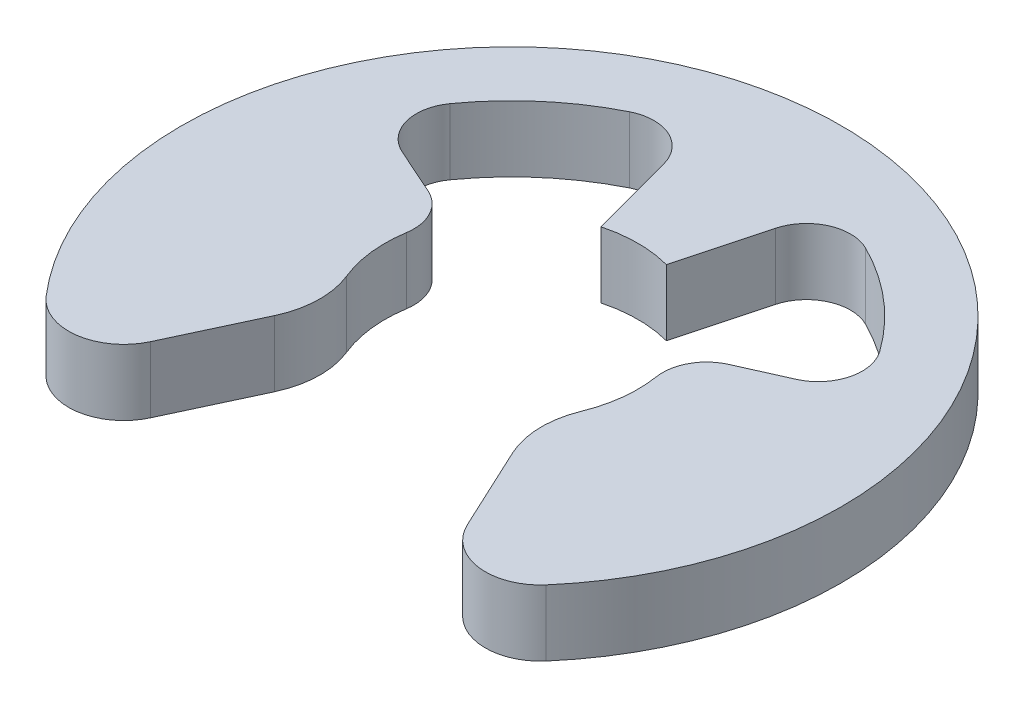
ISO-10303-21;
HEADER;
FILE_DESCRIPTION(('STEP AP214'),'2;1');
FILE_NAME('part.step','',(''),(''),'','','');
FILE_SCHEMA(('AUTOMOTIVE_DESIGN { 1 0 10303 214 1 1 1 1 }'));
ENDSEC;
DATA;
#1=APPLICATION_CONTEXT('core data for automotive mechanical design processes');
#2=APPLICATION_PROTOCOL_DEFINITION('international standard','automotive_design',2000,#1);
#3=PRODUCT_CONTEXT('',#1,'mechanical');
#4=PRODUCT('Part','Part','',(#3));
#5=PRODUCT_RELATED_PRODUCT_CATEGORY('part','',(#4));
#6=PRODUCT_DEFINITION_FORMATION('','',#4);
#7=PRODUCT_DEFINITION_CONTEXT('part definition',#1,'design');
#8=PRODUCT_DEFINITION('design','',#6,#7);
#9=PRODUCT_DEFINITION_SHAPE('','',#8);
#10=(LENGTH_UNIT() NAMED_UNIT(*) SI_UNIT(.MILLI.,.METRE.));
#11=(NAMED_UNIT(*) PLANE_ANGLE_UNIT() SI_UNIT($,.RADIAN.));
#12=(NAMED_UNIT(*) SI_UNIT($,.STERADIAN.) SOLID_ANGLE_UNIT());
#13=UNCERTAINTY_MEASURE_WITH_UNIT(LENGTH_MEASURE(1.E-05),#10,'distance_accuracy_value','');
#14=(GEOMETRIC_REPRESENTATION_CONTEXT(3) GLOBAL_UNCERTAINTY_ASSIGNED_CONTEXT((#13)) GLOBAL_UNIT_ASSIGNED_CONTEXT((#10,
#11,#12)) REPRESENTATION_CONTEXT('',''));
#15=CARTESIAN_POINT('',(0.,0.,0.));
#16=DIRECTION('',(0.,0.,1.));
#17=DIRECTION('',(1.,0.,0.));
#18=AXIS2_PLACEMENT_3D('',#15,#16,#17);
#19=CARTESIAN_POINT('',(0.,-0.3,0.));
#20=DIRECTION('',(0.,-1.,0.));
#21=DIRECTION('',(0.,0.,-1.));
#22=AXIS2_PLACEMENT_3D('',#19,#20,#21);
#23=PLANE('',#22);
#24=DIRECTION('',(-0.422618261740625,0.,0.906307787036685));
#25=VECTOR('',#24,1.);
#26=CARTESIAN_POINT('',(-0.5408875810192,-0.3,0.5357544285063));
#27=LINE('',#26,#25);
#28=CARTESIAN_POINT('',(-0.540887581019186,-0.3,0.535754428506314));
#29=VERTEX_POINT('',#28);
#30=CARTESIAN_POINT('',(-0.720660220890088,-0.3,0.921278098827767));
#31=VERTEX_POINT('',#30);
#32=EDGE_CURVE('E190',#29,#31,#27,.T.);
#33=ORIENTED_EDGE('',*,*,#32,.T.);
#34=CARTESIAN_POINT('',(-0.9472371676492,-0.3,0.8156235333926));
#35=DIRECTION('',(0.,1.,0.));
#36=DIRECTION('',(0.,0.,1.));
#37=AXIS2_PLACEMENT_3D('',#34,#35,#36);
#38=CIRCLE('',#37,0.25);
#39=CARTESIAN_POINT('',(-1.13668460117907,-0.3,0.978748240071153));
#40=VERTEX_POINT('',#39);
#41=EDGE_CURVE('E175',#40,#31,#38,.T.);
#42=ORIENTED_EDGE('',*,*,#41,.F.);
#43=CARTESIAN_POINT('',(0.,-0.3,0.));
#44=DIRECTION('',(0.,-1.,0.));
#45=DIRECTION('',(0.,0.,-1.));
#46=AXIS2_PLACEMENT_3D('',#43,#44,#45);
#47=CIRCLE('',#46,1.5);
#48=CARTESIAN_POINT('',(1.13668460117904,-0.3,0.978748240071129));
#49=VERTEX_POINT('',#48);
#50=EDGE_CURVE('E173',#49,#40,#47,.F.);
#51=ORIENTED_EDGE('',*,*,#50,.F.);
#52=CARTESIAN_POINT('',(0.9472371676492,-0.3,0.8156235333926));
#53=DIRECTION('',(0.,1.,0.));
#54=DIRECTION('',(0.,0.,1.));
#55=AXIS2_PLACEMENT_3D('',#52,#53,#54);
#56=CIRCLE('',#55,0.25);
#57=CARTESIAN_POINT('',(0.72066022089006,-0.3,0.921278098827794));
#58=VERTEX_POINT('',#57);
#59=EDGE_CURVE('E19',#49,#58,#56,.F.);
#60=ORIENTED_EDGE('',*,*,#59,.T.);
#61=DIRECTION('',(-0.422618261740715,0.,-0.906307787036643));
#62=VECTOR('',#61,1.);
#63=CARTESIAN_POINT('',(0.7206602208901,-0.3,0.9212780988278));
#64=LINE('',#63,#62);
#65=CARTESIAN_POINT('',(0.540887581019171,-0.3,0.535754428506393));
#66=VERTEX_POINT('',#65);
#67=EDGE_CURVE('E171',#58,#66,#64,.T.);
#68=ORIENTED_EDGE('',*,*,#67,.T.);
#69=CARTESIAN_POINT('',(0.9034106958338,-0.3,0.3667071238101));
#70=DIRECTION('',(0.,1.,0.));
#71=DIRECTION('',(0.,0.,1.));
#72=AXIS2_PLACEMENT_3D('',#69,#70,#71);
#73=CIRCLE('',#72,0.4);
#74=CARTESIAN_POINT('',(0.532780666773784,-0.3,0.216263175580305));
#75=VERTEX_POINT('',#74);
#76=EDGE_CURVE('E209',#66,#75,#73,.F.);
#77=ORIENTED_EDGE('',*,*,#76,.T.);
#78=CARTESIAN_POINT('',(0.,-0.3,0.));
#79=DIRECTION('',(0.,-1.,0.));
#80=DIRECTION('',(0.,0.,-1.));
#81=AXIS2_PLACEMENT_3D('',#78,#79,#80);
#82=CIRCLE('',#81,0.575);
#83=CARTESIAN_POINT('',(0.567850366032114,-0.3,-0.0903933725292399));
#84=VERTEX_POINT('',#83);
#85=EDGE_CURVE('E285',#75,#84,#82,.F.);
#86=ORIENTED_EDGE('',*,*,#85,.T.);
#87=CARTESIAN_POINT('',(0.7653635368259,-0.3,-0.1218345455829));
#88=DIRECTION('',(0.,1.,0.));
#89=DIRECTION('',(0.,0.,1.));
#90=AXIS2_PLACEMENT_3D('',#87,#88,#89);
#91=CIRCLE('',#90,0.2);
#92=CARTESIAN_POINT('',(0.684016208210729,-0.3,-0.304543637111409));
#93=VERTEX_POINT('',#92);
#94=EDGE_CURVE('E207',#84,#93,#91,.F.);
#95=ORIENTED_EDGE('',*,*,#94,.T.);
#96=DIRECTION('',(0.913545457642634,0.,-0.406736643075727));
#97=VECTOR('',#96,1.);
#98=CARTESIAN_POINT('',(0.6840162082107,-0.3,-0.3045436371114));
#99=LINE('',#98,#97);
#100=CARTESIAN_POINT('',(0.895088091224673,-0.3,-0.398518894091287));
#101=VERTEX_POINT('',#100);
#102=EDGE_CURVE('E204',#93,#101,#99,.T.);
#103=ORIENTED_EDGE('',*,*,#102,.T.);
#104=CARTESIAN_POINT('',(0.8137407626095,-0.3,-0.5812279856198));
#105=DIRECTION('',(0.,-1.,0.));
#106=DIRECTION('',(0.,0.,-1.));
#107=AXIS2_PLACEMENT_3D('',#104,#105,#106);
#108=CIRCLE('',#107,0.2);
#109=CARTESIAN_POINT('',(0.976488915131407,-0.3,-0.697473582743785));
#110=VERTEX_POINT('',#109);
#111=EDGE_CURVE('E206',#101,#110,#108,.F.);
#112=ORIENTED_EDGE('',*,*,#111,.T.);
#113=CARTESIAN_POINT('',(0.,-0.3,0.));
#114=DIRECTION('',(0.,-1.,0.));
#115=DIRECTION('',(0.,0.,-1.));
#116=AXIS2_PLACEMENT_3D('',#113,#114,#115);
#117=CIRCLE('',#116,1.2);
#118=CARTESIAN_POINT('',(0.536130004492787,-0.3,-1.07357562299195));
#119=VERTEX_POINT('',#118);
#120=EDGE_CURVE('E281',#110,#119,#117,.F.);
#121=ORIENTED_EDGE('',*,*,#120,.T.);
#122=CARTESIAN_POINT('',(0.446775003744,-0.3,-0.8946463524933));
#123=DIRECTION('',(0.,-1.,0.));
#124=DIRECTION('',(0.,0.,-1.));
#125=AXIS2_PLACEMENT_3D('',#122,#123,#124);
#126=CIRCLE('',#125,0.2);
#127=CARTESIAN_POINT('',(0.253589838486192,-0.3,-0.946410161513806));
#128=VERTEX_POINT('',#127);
#129=EDGE_CURVE('E203',#119,#128,#126,.F.);
#130=ORIENTED_EDGE('',*,*,#129,.T.);
#131=DIRECTION('',(-0.258819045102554,0.,0.965925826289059));
#132=VECTOR('',#131,1.);
#133=CARTESIAN_POINT('',(0.2535898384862,-0.3,-0.9464101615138));
#134=LINE('',#133,#132);
#135=CARTESIAN_POINT('',(0.148820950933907,-0.3,-0.555407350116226));
#136=VERTEX_POINT('',#135);
#137=EDGE_CURVE('E201',#128,#136,#134,.T.);
#138=ORIENTED_EDGE('',*,*,#137,.T.);
#139=CARTESIAN_POINT('',(0.,-0.3,0.));
#140=DIRECTION('',(0.,-1.,0.));
#141=DIRECTION('',(0.,0.,-1.));
#142=AXIS2_PLACEMENT_3D('',#139,#140,#141);
#143=CIRCLE('',#142,0.575);
#144=CARTESIAN_POINT('',(-0.148820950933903,-0.3,-0.555407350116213));
#145=VERTEX_POINT('',#144);
#146=EDGE_CURVE('E200',#136,#145,#143,.F.);
#147=ORIENTED_EDGE('',*,*,#146,.T.);
#148=DIRECTION('',(-0.258819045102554,0.,-0.965925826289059));
#149=VECTOR('',#148,1.);
#150=CARTESIAN_POINT('',(-0.1488209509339,-0.3,-0.5554073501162));
#151=LINE('',#150,#149);
#152=CARTESIAN_POINT('',(-0.253589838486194,-0.3,-0.946410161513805));
#153=VERTEX_POINT('',#152);
#154=EDGE_CURVE('E197',#145,#153,#151,.T.);
#155=ORIENTED_EDGE('',*,*,#154,.T.);
#156=CARTESIAN_POINT('',(-0.446775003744,-0.3,-0.8946463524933));
#157=DIRECTION('',(0.,-1.,0.));
#158=DIRECTION('',(0.,0.,-1.));
#159=AXIS2_PLACEMENT_3D('',#156,#157,#158);
#160=CIRCLE('',#159,0.2);
#161=CARTESIAN_POINT('',(-0.536130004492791,-0.3,-1.07357562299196));
#162=VERTEX_POINT('',#161);
#163=EDGE_CURVE('E199',#153,#162,#160,.F.);
#164=ORIENTED_EDGE('',*,*,#163,.T.);
#165=CARTESIAN_POINT('',(0.,-0.3,0.));
#166=DIRECTION('',(0.,-1.,0.));
#167=DIRECTION('',(0.,0.,-1.));
#168=AXIS2_PLACEMENT_3D('',#165,#166,#167);
#169=CIRCLE('',#168,1.2);
#170=CARTESIAN_POINT('',(-0.976488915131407,-0.3,-0.697473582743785));
#171=VERTEX_POINT('',#170);
#172=EDGE_CURVE('E276',#162,#171,#169,.F.);
#173=ORIENTED_EDGE('',*,*,#172,.T.);
#174=CARTESIAN_POINT('',(-0.8137407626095,-0.3,-0.5812279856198));
#175=DIRECTION('',(0.,-1.,0.));
#176=DIRECTION('',(0.,0.,-1.));
#177=AXIS2_PLACEMENT_3D('',#174,#175,#176);
#178=CIRCLE('',#177,0.2);
#179=CARTESIAN_POINT('',(-0.895088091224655,-0.3,-0.398518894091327));
#180=VERTEX_POINT('',#179);
#181=EDGE_CURVE('E196',#171,#180,#178,.F.);
#182=ORIENTED_EDGE('',*,*,#181,.T.);
#183=DIRECTION('',(0.913545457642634,0.,0.406736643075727));
#184=VECTOR('',#183,1.);
#185=CARTESIAN_POINT('',(-0.8950880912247,-0.3,-0.3985188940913));
#186=LINE('',#185,#184);
#187=CARTESIAN_POINT('',(-0.684016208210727,-0.3,-0.304543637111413));
#188=VERTEX_POINT('',#187);
#189=EDGE_CURVE('E193',#180,#188,#186,.T.);
#190=ORIENTED_EDGE('',*,*,#189,.T.);
#191=CARTESIAN_POINT('',(-0.7653635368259,-0.3,-0.1218345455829));
#192=DIRECTION('',(0.,1.,0.));
#193=DIRECTION('',(0.,0.,1.));
#194=AXIS2_PLACEMENT_3D('',#191,#192,#193);
#195=CIRCLE('',#194,0.2);
#196=CARTESIAN_POINT('',(-0.567850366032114,-0.3,-0.0903933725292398));
#197=VERTEX_POINT('',#196);
#198=EDGE_CURVE('E195',#188,#197,#195,.F.);
#199=ORIENTED_EDGE('',*,*,#198,.T.);
#200=CARTESIAN_POINT('',(0.,-0.3,0.));
#201=DIRECTION('',(0.,-1.,0.));
#202=DIRECTION('',(0.,0.,-1.));
#203=AXIS2_PLACEMENT_3D('',#200,#201,#202);
#204=CIRCLE('',#203,0.575);
#205=CARTESIAN_POINT('',(-0.532780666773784,-0.3,0.216263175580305));
#206=VERTEX_POINT('',#205);
#207=EDGE_CURVE('E272',#197,#206,#204,.F.);
#208=ORIENTED_EDGE('',*,*,#207,.T.);
#209=CARTESIAN_POINT('',(-0.9034106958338,-0.3,0.3667071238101));
#210=DIRECTION('',(0.,1.,0.));
#211=DIRECTION('',(0.,0.,1.));
#212=AXIS2_PLACEMENT_3D('',#209,#210,#211);
#213=CIRCLE('',#212,0.4);
#214=EDGE_CURVE('E192',#206,#29,#213,.F.);
#215=ORIENTED_EDGE('',*,*,#214,.T.);
#216=EDGE_LOOP('',(#33,#42,#51,#60,#68,#77,#86,#95,#103,#112,#121,#130,#138,#147,#155,#164,#173,
#182,#190,#199,#208,#215));
#217=FACE_BOUND('',#216,.T.);
#218=ADVANCED_FACE('F16',(#217),#23,.T.);
#219=CARTESIAN_POINT('',(-0.9472371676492,-0.3084106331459,0.8156235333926));
#220=DIRECTION('',(0.,1.,0.));
#221=DIRECTION('',(0.,0.,1.));
#222=AXIS2_PLACEMENT_3D('',#219,#220,#221);
#223=CYLINDRICAL_SURFACE('',#222,0.25);
#224=ORIENTED_EDGE('',*,*,#41,.T.);
#225=DIRECTION('',(0.,1.,0.));
#226=VECTOR('',#225,1.);
#227=CARTESIAN_POINT('',(-0.720660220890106,0.,0.921278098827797));
#228=LINE('',#227,#226);
#229=CARTESIAN_POINT('',(-0.720660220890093,0.,0.921278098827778));
#230=VERTEX_POINT('',#229);
#231=EDGE_CURVE('E259',#230,#31,#228,.F.);
#232=ORIENTED_EDGE('',*,*,#231,.F.);
#233=CARTESIAN_POINT('',(-0.9472371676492,0.,0.8156235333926));
#234=DIRECTION('',(0.,1.,0.));
#235=DIRECTION('',(0.,0.,1.));
#236=AXIS2_PLACEMENT_3D('',#233,#234,#235);
#237=CIRCLE('',#236,0.25);
#238=CARTESIAN_POINT('',(-1.13668460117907,0.,0.978748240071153));
#239=VERTEX_POINT('',#238);
#240=EDGE_CURVE('E256',#230,#239,#237,.F.);
#241=ORIENTED_EDGE('',*,*,#240,.T.);
#242=DIRECTION('',(0.,-1.,0.));
#243=VECTOR('',#242,1.);
#244=CARTESIAN_POINT('',(-1.13668460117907,0.,0.978748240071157));
#245=LINE('',#244,#243);
#246=EDGE_CURVE('E178',#40,#239,#245,.F.);
#247=ORIENTED_EDGE('',*,*,#246,.F.);
#248=EDGE_LOOP('',(#224,#232,#241,#247));
#249=FACE_BOUND('',#248,.T.);
#250=ADVANCED_FACE('F398',(#249),#223,.T.);
#251=CARTESIAN_POINT('',(0.,0.,0.));
#252=DIRECTION('',(0.,-1.,0.));
#253=DIRECTION('',(0.,0.,-1.));
#254=AXIS2_PLACEMENT_3D('',#251,#252,#253);
#255=CYLINDRICAL_SURFACE('',#254,1.5);
#256=ORIENTED_EDGE('',*,*,#50,.T.);
#257=ORIENTED_EDGE('',*,*,#246,.T.);
#258=CARTESIAN_POINT('',(0.,0.,0.));
#259=DIRECTION('',(0.,-1.,0.));
#260=DIRECTION('',(0.,0.,-1.));
#261=AXIS2_PLACEMENT_3D('',#258,#259,#260);
#262=CIRCLE('',#261,1.5);
#263=CARTESIAN_POINT('',(1.13668460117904,0.,0.978748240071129));
#264=VERTEX_POINT('',#263);
#265=EDGE_CURVE('E183',#239,#264,#262,.T.);
#266=ORIENTED_EDGE('',*,*,#265,.T.);
#267=DIRECTION('',(0.,1.,0.));
#268=VECTOR('',#267,1.);
#269=CARTESIAN_POINT('',(1.13668460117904,-0.3084106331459,0.978748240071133));
#270=LINE('',#269,#268);
#271=EDGE_CURVE('E166',#49,#264,#270,.T.);
#272=ORIENTED_EDGE('',*,*,#271,.F.);
#273=EDGE_LOOP('',(#256,#257,#266,#272));
#274=FACE_BOUND('',#273,.T.);
#275=ADVANCED_FACE('F181',(#274),#255,.T.);
#276=CARTESIAN_POINT('',(0.9472371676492,-0.3084106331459,0.8156235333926));
#277=DIRECTION('',(0.,1.,0.));
#278=DIRECTION('',(0.,0.,1.));
#279=AXIS2_PLACEMENT_3D('',#276,#277,#278);
#280=CYLINDRICAL_SURFACE('',#279,0.25);
#281=ORIENTED_EDGE('',*,*,#59,.F.);
#282=ORIENTED_EDGE('',*,*,#271,.T.);
#283=CARTESIAN_POINT('',(0.9472371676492,0.,0.8156235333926));
#284=DIRECTION('',(0.,1.,0.));
#285=DIRECTION('',(0.,0.,1.));
#286=AXIS2_PLACEMENT_3D('',#283,#284,#285);
#287=CIRCLE('',#286,0.25);
#288=CARTESIAN_POINT('',(0.72066022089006,0.,0.921278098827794));
#289=VERTEX_POINT('',#288);
#290=EDGE_CURVE('E253',#264,#289,#287,.F.);
#291=ORIENTED_EDGE('',*,*,#290,.T.);
#292=DIRECTION('',(0.,1.,0.));
#293=VECTOR('',#292,1.);
#294=CARTESIAN_POINT('',(0.720660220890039,0.,0.921278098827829));
#295=LINE('',#294,#293);
#296=EDGE_CURVE('E168',#58,#289,#295,.T.);
#297=ORIENTED_EDGE('',*,*,#296,.F.);
#298=EDGE_LOOP('',(#281,#282,#291,#297));
#299=FACE_BOUND('',#298,.T.);
#300=ADVANCED_FACE('F163',(#299),#280,.T.);
#301=CARTESIAN_POINT('',(0.8631235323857,0.,1.226791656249));
#302=DIRECTION('',(-0.906307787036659,0.,0.422618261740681));
#303=DIRECTION('',(0.422618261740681,0.,0.906307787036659));
#304=AXIS2_PLACEMENT_3D('',#301,#302,#303);
#305=PLANE('',#304);
#306=ORIENTED_EDGE('',*,*,#67,.F.);
#307=ORIENTED_EDGE('',*,*,#296,.T.);
#308=DIRECTION('',(-0.422618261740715,0.,-0.906307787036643));
#309=VECTOR('',#308,1.);
#310=CARTESIAN_POINT('',(0.7206602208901,0.,0.9212780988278));
#311=LINE('',#310,#309);
#312=CARTESIAN_POINT('',(0.540887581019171,0.,0.535754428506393));
#313=VERTEX_POINT('',#312);
#314=EDGE_CURVE('E252',#289,#313,#311,.T.);
#315=ORIENTED_EDGE('',*,*,#314,.T.);
#316=DIRECTION('',(0.,1.,0.));
#317=VECTOR('',#316,1.);
#318=CARTESIAN_POINT('',(0.540887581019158,-0.3084106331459,0.53575442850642));
#319=LINE('',#318,#317);
#320=EDGE_CURVE('E185',#66,#313,#319,.T.);
#321=ORIENTED_EDGE('',*,*,#320,.F.);
#322=EDGE_LOOP('',(#306,#307,#315,#321));
#323=FACE_BOUND('',#322,.T.);
#324=ADVANCED_FACE('F446',(#323),#305,.T.);
#325=CARTESIAN_POINT('',(0.9034106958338,-0.3084106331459,0.3667071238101));
#326=DIRECTION('',(0.,1.,0.));
#327=DIRECTION('',(0.,0.,1.));
#328=AXIS2_PLACEMENT_3D('',#325,#326,#327);
#329=CYLINDRICAL_SURFACE('',#328,0.4);
#330=ORIENTED_EDGE('',*,*,#76,.F.);
#331=ORIENTED_EDGE('',*,*,#320,.T.);
#332=CARTESIAN_POINT('',(0.9034106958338,0.,0.3667071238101));
#333=DIRECTION('',(0.,1.,0.));
#334=DIRECTION('',(0.,0.,1.));
#335=AXIS2_PLACEMENT_3D('',#332,#333,#334);
#336=CIRCLE('',#335,0.4);
#337=CARTESIAN_POINT('',(0.532780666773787,0.,0.216263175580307));
#338=VERTEX_POINT('',#337);
#339=EDGE_CURVE('E249',#313,#338,#336,.F.);
#340=ORIENTED_EDGE('',*,*,#339,.T.);
#341=DIRECTION('',(0.,-1.,0.));
#342=VECTOR('',#341,1.);
#343=CARTESIAN_POINT('',(0.532780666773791,0.,0.216263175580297));
#344=LINE('',#343,#342);
#345=EDGE_CURVE('E292',#338,#75,#344,.T.);
#346=ORIENTED_EDGE('',*,*,#345,.T.);
#347=EDGE_LOOP('',(#330,#331,#340,#346));
#348=FACE_BOUND('',#347,.T.);
#349=ADVANCED_FACE('F293',(#348),#329,.T.);
#350=CARTESIAN_POINT('',(0.,0.,0.));
#351=DIRECTION('',(0.,-1.,0.));
#352=DIRECTION('',(0.,0.,-1.));
#353=AXIS2_PLACEMENT_3D('',#350,#351,#352);
#354=CYLINDRICAL_SURFACE('',#353,0.575);
#355=DIRECTION('',(0.,1.,0.));
#356=VECTOR('',#355,1.);
#357=CARTESIAN_POINT('',(0.567850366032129,-0.3084106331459,-0.0903933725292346));
#358=LINE('',#357,#356);
#359=CARTESIAN_POINT('',(0.567850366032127,0.,-0.090393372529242));
#360=VERTEX_POINT('',#359);
#361=EDGE_CURVE('E297',#84,#360,#358,.T.);
#362=ORIENTED_EDGE('',*,*,#361,.F.);
#363=ORIENTED_EDGE('',*,*,#85,.F.);
#364=ORIENTED_EDGE('',*,*,#345,.F.);
#365=CARTESIAN_POINT('',(0.,0.,0.));
#366=DIRECTION('',(0.,-1.,0.));
#367=DIRECTION('',(0.,0.,-1.));
#368=AXIS2_PLACEMENT_3D('',#365,#366,#367);
#369=CIRCLE('',#368,0.575);
#370=EDGE_CURVE('E246',#338,#360,#369,.F.);
#371=ORIENTED_EDGE('',*,*,#370,.T.);
#372=EDGE_LOOP('',(#362,#363,#364,#371));
#373=FACE_BOUND('',#372,.T.);
#374=ADVANCED_FACE('F299',(#373),#354,.F.);
#375=CARTESIAN_POINT('',(0.7653635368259,-0.3084106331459,-0.1218345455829));
#376=DIRECTION('',(0.,1.,0.));
#377=DIRECTION('',(0.,0.,1.));
#378=AXIS2_PLACEMENT_3D('',#375,#376,#377);
#379=CYLINDRICAL_SURFACE('',#378,0.2);
#380=ORIENTED_EDGE('',*,*,#94,.F.);
#381=ORIENTED_EDGE('',*,*,#361,.T.);
#382=CARTESIAN_POINT('',(0.7653635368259,0.,-0.1218345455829));
#383=DIRECTION('',(0.,1.,0.));
#384=DIRECTION('',(0.,0.,1.));
#385=AXIS2_PLACEMENT_3D('',#382,#383,#384);
#386=CIRCLE('',#385,0.2);
#387=CARTESIAN_POINT('',(0.684016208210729,0.,-0.304543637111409));
#388=VERTEX_POINT('',#387);
#389=EDGE_CURVE('E243',#360,#388,#386,.F.);
#390=ORIENTED_EDGE('',*,*,#389,.T.);
#391=DIRECTION('',(0.,1.,0.));
#392=VECTOR('',#391,1.);
#393=CARTESIAN_POINT('',(0.684016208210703,0.,-0.304543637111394));
#394=LINE('',#393,#392);
#395=EDGE_CURVE('E303',#93,#388,#394,.T.);
#396=ORIENTED_EDGE('',*,*,#395,.F.);
#397=EDGE_LOOP('',(#380,#381,#390,#396));
#398=FACE_BOUND('',#397,.T.);
#399=ADVANCED_FACE('F306',(#398),#379,.T.);
#400=CARTESIAN_POINT('',(0.5252886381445,0.,-0.2338735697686));
#401=DIRECTION('',(-0.4067366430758,0.,-0.913545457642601));
#402=DIRECTION('',(-0.913545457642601,0.,0.4067366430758));
#403=AXIS2_PLACEMENT_3D('',#400,#401,#402);
#404=PLANE('',#403);
#405=ORIENTED_EDGE('',*,*,#102,.F.);
#406=ORIENTED_EDGE('',*,*,#395,.T.);
#407=DIRECTION('',(0.913545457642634,0.,-0.406736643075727));
#408=VECTOR('',#407,1.);
#409=CARTESIAN_POINT('',(0.6840162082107,0.,-0.3045436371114));
#410=LINE('',#409,#408);
#411=CARTESIAN_POINT('',(0.895088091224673,0.,-0.398518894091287));
#412=VERTEX_POINT('',#411);
#413=EDGE_CURVE('E242',#388,#412,#410,.T.);
#414=ORIENTED_EDGE('',*,*,#413,.T.);
#415=DIRECTION('',(0.,-1.,0.));
#416=VECTOR('',#415,1.);
#417=CARTESIAN_POINT('',(0.895088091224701,0.00718644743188,-0.398518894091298));
#418=LINE('',#417,#416);
#419=EDGE_CURVE('E313',#412,#101,#418,.T.);
#420=ORIENTED_EDGE('',*,*,#419,.T.);
#421=EDGE_LOOP('',(#405,#406,#414,#420));
#422=FACE_BOUND('',#421,.T.);
#423=ADVANCED_FACE('F314',(#422),#404,.T.);
#424=CARTESIAN_POINT('',(0.8137407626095,0.00718644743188,-0.5812279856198));
#425=DIRECTION('',(0.,-1.,0.));
#426=DIRECTION('',(0.,0.,-1.));
#427=AXIS2_PLACEMENT_3D('',#424,#425,#426);
#428=CYLINDRICAL_SURFACE('',#427,0.2);
#429=ORIENTED_EDGE('',*,*,#111,.F.);
#430=ORIENTED_EDGE('',*,*,#419,.F.);
#431=CARTESIAN_POINT('',(0.8137407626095,0.,-0.5812279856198));
#432=DIRECTION('',(0.,-1.,0.));
#433=DIRECTION('',(0.,0.,-1.));
#434=AXIS2_PLACEMENT_3D('',#431,#432,#433);
#435=CIRCLE('',#434,0.2);
#436=CARTESIAN_POINT('',(0.976500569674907,0.,-0.697457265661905));
#437=VERTEX_POINT('',#436);
#438=EDGE_CURVE('E239',#412,#437,#435,.F.);
#439=ORIENTED_EDGE('',*,*,#438,.T.);
#440=CARTESIAN_POINT('',(0.976500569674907,0.,-0.697457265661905));
#441=CARTESIAN_POINT('',(0.976500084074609,-0.0125,-0.697457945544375));
#442=CARTESIAN_POINT('',(0.9764995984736,-0.025,-0.697458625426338));
#443=CARTESIAN_POINT('',(0.976498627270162,-0.05,-0.697459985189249));
#444=CARTESIAN_POINT('',(0.976498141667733,-0.0625,-0.697460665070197));
#445=CARTESIAN_POINT('',(0.976497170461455,-0.0875,-0.697462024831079));
#446=CARTESIAN_POINT('',(0.976496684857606,-0.1,-0.697462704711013));
#447=CARTESIAN_POINT('',(0.976495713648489,-0.125,-0.697464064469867));
#448=CARTESIAN_POINT('',(0.976495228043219,-0.1375,-0.697464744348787));
#449=CARTESIAN_POINT('',(0.976494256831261,-0.1625,-0.697466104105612));
#450=CARTESIAN_POINT('',(0.976493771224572,-0.175,-0.697466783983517));
#451=CARTESIAN_POINT('',(0.976492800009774,-0.2,-0.697468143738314));
#452=CARTESIAN_POINT('',(0.976492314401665,-0.2125,-0.697468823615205));
#453=CARTESIAN_POINT('',(0.976491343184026,-0.2375,-0.697470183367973));
#454=CARTESIAN_POINT('',(0.976490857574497,-0.25,-0.69747086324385));
#455=CARTESIAN_POINT('',(0.976489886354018,-0.275,-0.697472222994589));
#456=CARTESIAN_POINT('',(0.976489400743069,-0.2875,-0.697472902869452));
#457=CARTESIAN_POINT('',(0.97648891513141,-0.3,-0.697473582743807));
#458=B_SPLINE_CURVE_WITH_KNOTS('',3,(#440,#441,#442,#443,#444,#445,#446,#447,#448,#449,#450,
#451,#452,#453,#454,#455,#456,#457),.UNSPECIFIED.,.F.,.F.,(4,2,2,2,2,2,2,2,4),(0.,
0.0375000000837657,0.0750000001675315,0.112500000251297,0.150000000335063,0.187500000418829,
0.225000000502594,0.26250000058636,0.300000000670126),.UNSPECIFIED.);
#459=EDGE_CURVE('E268',#437,#110,#458,.T.);
#460=ORIENTED_EDGE('',*,*,#459,.T.);
#461=EDGE_LOOP('',(#429,#430,#439,#460));
#462=FACE_BOUND('',#461,.T.);
#463=ADVANCED_FACE('F319',(#462),#428,.F.);
#464=CARTESIAN_POINT('',(0.,0.,0.));
#465=DIRECTION('',(0.,-1.,0.));
#466=DIRECTION('',(0.,0.,-1.));
#467=AXIS2_PLACEMENT_3D('',#464,#465,#466);
#468=CYLINDRICAL_SURFACE('',#467,1.2);
#469=ORIENTED_EDGE('',*,*,#459,.F.);
#470=CARTESIAN_POINT('',(0.,0.,0.));
#471=DIRECTION('',(0.,-1.,0.));
#472=DIRECTION('',(0.,0.,-1.));
#473=AXIS2_PLACEMENT_3D('',#470,#471,#472);
#474=CIRCLE('',#473,1.2);
#475=CARTESIAN_POINT('',(0.536130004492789,0.,-1.07357562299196));
#476=VERTEX_POINT('',#475);
#477=EDGE_CURVE('E236',#437,#476,#474,.F.);
#478=ORIENTED_EDGE('',*,*,#477,.T.);
#479=DIRECTION('',(0.,-1.,0.));
#480=VECTOR('',#479,1.);
#481=CARTESIAN_POINT('',(0.536130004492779,0.,-1.07357562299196));
#482=LINE('',#481,#480);
#483=EDGE_CURVE('E265',#476,#119,#482,.T.);
#484=ORIENTED_EDGE('',*,*,#483,.T.);
#485=ORIENTED_EDGE('',*,*,#120,.F.);
#486=EDGE_LOOP('',(#469,#478,#484,#485));
#487=FACE_BOUND('',#486,.T.);
#488=ADVANCED_FACE('F324',(#487),#468,.F.);
#489=CARTESIAN_POINT('',(0.446775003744,0.00718644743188,-0.8946463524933));
#490=DIRECTION('',(0.,-1.,0.));
#491=DIRECTION('',(0.,0.,-1.));
#492=AXIS2_PLACEMENT_3D('',#489,#490,#491);
#493=CYLINDRICAL_SURFACE('',#492,0.2);
#494=ORIENTED_EDGE('',*,*,#483,.F.);
#495=CARTESIAN_POINT('',(0.446775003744,0.,-0.8946463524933));
#496=DIRECTION('',(0.,-1.,0.));
#497=DIRECTION('',(0.,0.,-1.));
#498=AXIS2_PLACEMENT_3D('',#495,#496,#497);
#499=CIRCLE('',#498,0.2);
#500=CARTESIAN_POINT('',(0.253589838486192,0.,-0.946410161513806));
#501=VERTEX_POINT('',#500);
#502=EDGE_CURVE('E233',#476,#501,#499,.F.);
#503=ORIENTED_EDGE('',*,*,#502,.T.);
#504=DIRECTION('',(0.,1.,0.));
#505=VECTOR('',#504,1.);
#506=CARTESIAN_POINT('',(0.253589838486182,0.,-0.946410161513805));
#507=LINE('',#506,#505);
#508=EDGE_CURVE('E267',#128,#501,#507,.T.);
#509=ORIENTED_EDGE('',*,*,#508,.F.);
#510=ORIENTED_EDGE('',*,*,#129,.F.);
#511=EDGE_LOOP('',(#494,#503,#509,#510));
#512=FACE_BOUND('',#511,.T.);
#513=ADVANCED_FACE('F330',(#512),#493,.F.);
#514=CARTESIAN_POINT('',(0.310582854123,0.,-1.159110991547));
#515=DIRECTION('',(0.965925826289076,0.,0.258819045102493));
#516=DIRECTION('',(0.258819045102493,0.,-0.965925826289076));
#517=AXIS2_PLACEMENT_3D('',#514,#515,#516);
#518=PLANE('',#517);
#519=ORIENTED_EDGE('',*,*,#137,.F.);
#520=ORIENTED_EDGE('',*,*,#508,.T.);
#521=DIRECTION('',(-0.258819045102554,0.,0.965925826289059));
#522=VECTOR('',#521,1.);
#523=CARTESIAN_POINT('',(0.2535898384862,0.,-0.9464101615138));
#524=LINE('',#523,#522);
#525=CARTESIAN_POINT('',(0.148820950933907,0.,-0.555407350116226));
#526=VERTEX_POINT('',#525);
#527=EDGE_CURVE('E232',#501,#526,#524,.T.);
#528=ORIENTED_EDGE('',*,*,#527,.T.);
#529=DIRECTION('',(0.,-1.,0.));
#530=VECTOR('',#529,1.);
#531=CARTESIAN_POINT('',(0.148820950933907,0.,-0.555407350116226));
#532=LINE('',#531,#530);
#533=EDGE_CURVE('E335',#526,#136,#532,.T.);
#534=ORIENTED_EDGE('',*,*,#533,.T.);
#535=EDGE_LOOP('',(#519,#520,#528,#534));
#536=FACE_BOUND('',#535,.T.);
#537=ADVANCED_FACE('F337',(#536),#518,.T.);
#538=CARTESIAN_POINT('',(0.,0.,0.));
#539=DIRECTION('',(0.,-1.,0.));
#540=DIRECTION('',(0.,0.,-1.));
#541=AXIS2_PLACEMENT_3D('',#538,#539,#540);
#542=CYLINDRICAL_SURFACE('',#541,0.575);
#543=ORIENTED_EDGE('',*,*,#146,.F.);
#544=ORIENTED_EDGE('',*,*,#533,.F.);
#545=CARTESIAN_POINT('',(0.,0.,0.));
#546=DIRECTION('',(0.,-1.,0.));
#547=DIRECTION('',(0.,0.,-1.));
#548=AXIS2_PLACEMENT_3D('',#545,#546,#547);
#549=CIRCLE('',#548,0.575);
#550=CARTESIAN_POINT('',(-0.148820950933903,0.,-0.555407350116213));
#551=VERTEX_POINT('',#550);
#552=EDGE_CURVE('E229',#526,#551,#549,.F.);
#553=ORIENTED_EDGE('',*,*,#552,.T.);
#554=DIRECTION('',(0.,1.,0.));
#555=VECTOR('',#554,1.);
#556=CARTESIAN_POINT('',(-0.1488209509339,0.,-0.5554073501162));
#557=LINE('',#556,#555);
#558=EDGE_CURVE('E341',#145,#551,#557,.T.);
#559=ORIENTED_EDGE('',*,*,#558,.F.);
#560=EDGE_LOOP('',(#543,#544,#553,#559));
#561=FACE_BOUND('',#560,.T.);
#562=ADVANCED_FACE('F344',(#561),#542,.F.);
#563=CARTESIAN_POINT('',(-0.1488209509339,0.,-0.5554073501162));
#564=DIRECTION('',(-0.965925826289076,0.,0.258819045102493));
#565=DIRECTION('',(0.258819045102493,0.,0.965925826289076));
#566=AXIS2_PLACEMENT_3D('',#563,#564,#565);
#567=PLANE('',#566);
#568=DIRECTION('',(-0.258819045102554,0.,-0.965925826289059));
#569=VECTOR('',#568,1.);
#570=CARTESIAN_POINT('',(-0.1488209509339,0.,-0.5554073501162));
#571=LINE('',#570,#569);
#572=CARTESIAN_POINT('',(-0.253589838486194,0.,-0.946410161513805));
#573=VERTEX_POINT('',#572);
#574=EDGE_CURVE('E228',#551,#573,#571,.T.);
#575=ORIENTED_EDGE('',*,*,#574,.T.);
#576=DIRECTION('',(0.,-1.,0.));
#577=VECTOR('',#576,1.);
#578=CARTESIAN_POINT('',(-0.253589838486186,0.00718644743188,-0.946410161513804));
#579=LINE('',#578,#577);
#580=EDGE_CURVE('E264',#573,#153,#579,.T.);
#581=ORIENTED_EDGE('',*,*,#580,.T.);
#582=ORIENTED_EDGE('',*,*,#154,.F.);
#583=ORIENTED_EDGE('',*,*,#558,.T.);
#584=EDGE_LOOP('',(#575,#581,#582,#583));
#585=FACE_BOUND('',#584,.T.);
#586=ADVANCED_FACE('F350',(#585),#567,.T.);
#587=CARTESIAN_POINT('',(-0.446775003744,0.00718644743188,-0.8946463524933));
#588=DIRECTION('',(0.,-1.,0.));
#589=DIRECTION('',(0.,0.,-1.));
#590=AXIS2_PLACEMENT_3D('',#587,#588,#589);
#591=CYLINDRICAL_SURFACE('',#590,0.2);
#592=ORIENTED_EDGE('',*,*,#580,.F.);
#593=CARTESIAN_POINT('',(-0.446775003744,0.,-0.8946463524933));
#594=DIRECTION('',(0.,-1.,0.));
#595=DIRECTION('',(0.,0.,-1.));
#596=AXIS2_PLACEMENT_3D('',#593,#594,#595);
#597=CIRCLE('',#596,0.2);
#598=CARTESIAN_POINT('',(-0.536130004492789,0.,-1.07357562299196));
#599=VERTEX_POINT('',#598);
#600=EDGE_CURVE('E225',#573,#599,#597,.F.);
#601=ORIENTED_EDGE('',*,*,#600,.T.);
#602=DIRECTION('',(0.,-1.,0.));
#603=VECTOR('',#602,1.);
#604=CARTESIAN_POINT('',(-0.536130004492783,0.00718644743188,-1.07357562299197));
#605=LINE('',#604,#603);
#606=EDGE_CURVE('E260',#599,#162,#605,.T.);
#607=ORIENTED_EDGE('',*,*,#606,.T.);
#608=ORIENTED_EDGE('',*,*,#163,.F.);
#609=EDGE_LOOP('',(#592,#601,#607,#608));
#610=FACE_BOUND('',#609,.T.);
#611=ADVANCED_FACE('F355',(#610),#591,.F.);
#612=CARTESIAN_POINT('',(0.,0.,0.));
#613=DIRECTION('',(0.,-1.,0.));
#614=DIRECTION('',(0.,0.,-1.));
#615=AXIS2_PLACEMENT_3D('',#612,#613,#614);
#616=CYLINDRICAL_SURFACE('',#615,1.2);
#617=CARTESIAN_POINT('',(-0.976500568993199,0.,-0.697457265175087));
#618=CARTESIAN_POINT('',(-0.976500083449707,-0.0125,-0.697457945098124));
#619=CARTESIAN_POINT('',(-0.976499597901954,-0.025,-0.697458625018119));
#620=CARTESIAN_POINT('',(-0.976498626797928,-0.05,-0.697459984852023));
#621=CARTESIAN_POINT('',(-0.976498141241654,-0.0625,-0.697460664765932));
#622=CARTESIAN_POINT('',(-0.976497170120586,-0.0875,-0.697462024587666));
#623=CARTESIAN_POINT('',(-0.976496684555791,-0.1,-0.69746270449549));
#624=CARTESIAN_POINT('',(-0.976495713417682,-0.125,-0.697464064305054));
#625=CARTESIAN_POINT('',(-0.976495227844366,-0.1375,-0.697464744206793));
#626=CARTESIAN_POINT('',(-0.976494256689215,-0.1625,-0.697466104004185));
#627=CARTESIAN_POINT('',(-0.976493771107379,-0.175,-0.697466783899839));
#628=CARTESIAN_POINT('',(-0.976492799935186,-0.2,-0.69746814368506));
#629=CARTESIAN_POINT('',(-0.976492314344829,-0.2125,-0.697468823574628));
#630=CARTESIAN_POINT('',(-0.976491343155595,-0.2375,-0.697470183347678));
#631=CARTESIAN_POINT('',(-0.976490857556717,-0.25,-0.697470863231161));
#632=CARTESIAN_POINT('',(-0.976489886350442,-0.275,-0.69747222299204));
#633=CARTESIAN_POINT('',(-0.976489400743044,-0.2875,-0.697472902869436));
#634=CARTESIAN_POINT('',(-0.976488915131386,-0.3,-0.69747358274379));
#635=B_SPLINE_CURVE_WITH_KNOTS('',3,(#617,#618,#619,#620,#621,#622,#623,#624,#625,#626,#627,
#628,#629,#630,#631,#632,#633,#634),.UNSPECIFIED.,.F.,.F.,(4,2,2,2,2,2,2,2,4),(0.,
0.0375000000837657,0.0750000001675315,0.112500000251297,0.150000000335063,0.187500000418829,
0.225000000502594,0.26250000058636,0.300000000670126),.UNSPECIFIED.);
#636=CARTESIAN_POINT('',(-0.976500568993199,0.,-0.697457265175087));
#637=VERTEX_POINT('',#636);
#638=EDGE_CURVE('E263',#637,#171,#635,.T.);
#639=ORIENTED_EDGE('',*,*,#638,.T.);
#640=ORIENTED_EDGE('',*,*,#172,.F.);
#641=ORIENTED_EDGE('',*,*,#606,.F.);
#642=CARTESIAN_POINT('',(0.,0.,0.));
#643=DIRECTION('',(0.,-1.,0.));
#644=DIRECTION('',(0.,0.,-1.));
#645=AXIS2_PLACEMENT_3D('',#642,#643,#644);
#646=CIRCLE('',#645,1.2);
#647=EDGE_CURVE('E222',#599,#637,#646,.F.);
#648=ORIENTED_EDGE('',*,*,#647,.T.);
#649=EDGE_LOOP('',(#639,#640,#641,#648));
#650=FACE_BOUND('',#649,.T.);
#651=ADVANCED_FACE('F360',(#650),#616,.F.);
#652=CARTESIAN_POINT('',(-0.8137407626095,0.00718644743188,-0.5812279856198));
#653=DIRECTION('',(0.,-1.,0.));
#654=DIRECTION('',(0.,0.,-1.));
#655=AXIS2_PLACEMENT_3D('',#652,#653,#654);
#656=CYLINDRICAL_SURFACE('',#655,0.2);
#657=ORIENTED_EDGE('',*,*,#181,.F.);
#658=ORIENTED_EDGE('',*,*,#638,.F.);
#659=CARTESIAN_POINT('',(-0.8137407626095,0.,-0.5812279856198));
#660=DIRECTION('',(0.,-1.,0.));
#661=DIRECTION('',(0.,0.,-1.));
#662=AXIS2_PLACEMENT_3D('',#659,#660,#661);
#663=CIRCLE('',#662,0.2);
#664=CARTESIAN_POINT('',(-0.895088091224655,0.,-0.398518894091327));
#665=VERTEX_POINT('',#664);
#666=EDGE_CURVE('E219',#637,#665,#663,.F.);
#667=ORIENTED_EDGE('',*,*,#666,.T.);
#668=DIRECTION('',(0.,1.,0.));
#669=VECTOR('',#668,1.);
#670=CARTESIAN_POINT('',(-0.895088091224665,0.,-0.398518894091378));
#671=LINE('',#670,#669);
#672=EDGE_CURVE('E366',#180,#665,#671,.T.);
#673=ORIENTED_EDGE('',*,*,#672,.F.);
#674=EDGE_LOOP('',(#657,#658,#667,#673));
#675=FACE_BOUND('',#674,.T.);
#676=ADVANCED_FACE('F367',(#675),#656,.F.);
#677=CARTESIAN_POINT('',(-1.096254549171,0.,-0.488083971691));
#678=DIRECTION('',(0.4067366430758,0.,-0.913545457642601));
#679=DIRECTION('',(-0.913545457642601,0.,-0.4067366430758));
#680=AXIS2_PLACEMENT_3D('',#677,#678,#679);
#681=PLANE('',#680);
#682=DIRECTION('',(0.913545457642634,0.,0.406736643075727));
#683=VECTOR('',#682,1.);
#684=CARTESIAN_POINT('',(-0.8950880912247,0.,-0.3985188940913));
#685=LINE('',#684,#683);
#686=CARTESIAN_POINT('',(-0.684016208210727,0.,-0.304543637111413));
#687=VERTEX_POINT('',#686);
#688=EDGE_CURVE('E218',#665,#687,#685,.T.);
#689=ORIENTED_EDGE('',*,*,#688,.T.);
#690=DIRECTION('',(0.,1.,0.));
#691=VECTOR('',#690,1.);
#692=CARTESIAN_POINT('',(-0.684016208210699,-0.3084106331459,-0.304543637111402));
#693=LINE('',#692,#691);
#694=EDGE_CURVE('E372',#188,#687,#693,.T.);
#695=ORIENTED_EDGE('',*,*,#694,.F.);
#696=ORIENTED_EDGE('',*,*,#189,.F.);
#697=ORIENTED_EDGE('',*,*,#672,.T.);
#698=EDGE_LOOP('',(#689,#695,#696,#697));
#699=FACE_BOUND('',#698,.T.);
#700=ADVANCED_FACE('F374',(#699),#681,.T.);
#701=CARTESIAN_POINT('',(-0.7653635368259,-0.3084106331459,-0.1218345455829));
#702=DIRECTION('',(0.,1.,0.));
#703=DIRECTION('',(0.,0.,1.));
#704=AXIS2_PLACEMENT_3D('',#701,#702,#703);
#705=CYLINDRICAL_SURFACE('',#704,0.2);
#706=ORIENTED_EDGE('',*,*,#198,.F.);
#707=ORIENTED_EDGE('',*,*,#694,.T.);
#708=CARTESIAN_POINT('',(-0.7653635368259,0.,-0.1218345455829));
#709=DIRECTION('',(0.,1.,0.));
#710=DIRECTION('',(0.,0.,1.));
#711=AXIS2_PLACEMENT_3D('',#708,#709,#710);
#712=CIRCLE('',#711,0.2);
#713=CARTESIAN_POINT('',(-0.5678503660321,0.,-0.0903933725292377));
#714=VERTEX_POINT('',#713);
#715=EDGE_CURVE('E215',#687,#714,#712,.F.);
#716=ORIENTED_EDGE('',*,*,#715,.T.);
#717=DIRECTION('',(0.,-1.,0.));
#718=VECTOR('',#717,1.);
#719=CARTESIAN_POINT('',(-0.567850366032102,0.,-0.0903933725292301));
#720=LINE('',#719,#718);
#721=EDGE_CURVE('E378',#714,#197,#720,.T.);
#722=ORIENTED_EDGE('',*,*,#721,.T.);
#723=EDGE_LOOP('',(#706,#707,#716,#722));
#724=FACE_BOUND('',#723,.T.);
#725=ADVANCED_FACE('F381',(#724),#705,.T.);
#726=CARTESIAN_POINT('',(0.,0.,0.));
#727=DIRECTION('',(0.,-1.,0.));
#728=DIRECTION('',(0.,0.,-1.));
#729=AXIS2_PLACEMENT_3D('',#726,#727,#728);
#730=CYLINDRICAL_SURFACE('',#729,0.575);
#731=ORIENTED_EDGE('',*,*,#721,.F.);
#732=CARTESIAN_POINT('',(0.,0.,0.));
#733=DIRECTION('',(0.,-1.,0.));
#734=DIRECTION('',(0.,0.,-1.));
#735=AXIS2_PLACEMENT_3D('',#732,#733,#734);
#736=CIRCLE('',#735,0.575);
#737=CARTESIAN_POINT('',(-0.532780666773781,0.,0.216263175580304));
#738=VERTEX_POINT('',#737);
#739=EDGE_CURVE('E212',#714,#738,#736,.F.);
#740=ORIENTED_EDGE('',*,*,#739,.T.);
#741=DIRECTION('',(0.,1.,0.));
#742=VECTOR('',#741,1.);
#743=CARTESIAN_POINT('',(-0.532780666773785,-0.3084106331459,0.216263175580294));
#744=LINE('',#743,#742);
#745=EDGE_CURVE('E386',#206,#738,#744,.T.);
#746=ORIENTED_EDGE('',*,*,#745,.F.);
#747=ORIENTED_EDGE('',*,*,#207,.F.);
#748=EDGE_LOOP('',(#731,#740,#746,#747));
#749=FACE_BOUND('',#748,.T.);
#750=ADVANCED_FACE('F387',(#749),#730,.F.);
#751=CARTESIAN_POINT('',(-0.9034106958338,-0.3084106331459,0.3667071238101));
#752=DIRECTION('',(0.,1.,0.));
#753=DIRECTION('',(0.,0.,1.));
#754=AXIS2_PLACEMENT_3D('',#751,#752,#753);
#755=CYLINDRICAL_SURFACE('',#754,0.4);
#756=ORIENTED_EDGE('',*,*,#214,.F.);
#757=ORIENTED_EDGE('',*,*,#745,.T.);
#758=CARTESIAN_POINT('',(-0.9034106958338,0.,0.3667071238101));
#759=DIRECTION('',(0.,1.,0.));
#760=DIRECTION('',(0.,0.,1.));
#761=AXIS2_PLACEMENT_3D('',#758,#759,#760);
#762=CIRCLE('',#761,0.4);
#763=CARTESIAN_POINT('',(-0.540887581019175,0.,0.535754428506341));
#764=VERTEX_POINT('',#763);
#765=EDGE_CURVE('E25',#738,#764,#762,.F.);
#766=ORIENTED_EDGE('',*,*,#765,.T.);
#767=DIRECTION('',(0.,1.,0.));
#768=VECTOR('',#767,1.);
#769=CARTESIAN_POINT('',(-0.540887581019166,0.,0.535754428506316));
#770=LINE('',#769,#768);
#771=EDGE_CURVE('E33',#29,#764,#770,.T.);
#772=ORIENTED_EDGE('',*,*,#771,.F.);
#773=EDGE_LOOP('',(#756,#757,#766,#772));
#774=FACE_BOUND('',#773,.T.);
#775=ADVANCED_FACE('F392',(#774),#755,.T.);
#776=CARTESIAN_POINT('',(-0.455,0.,0.3515679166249));
#777=DIRECTION('',(0.906307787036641,0.,0.422618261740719));
#778=DIRECTION('',(0.422618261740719,0.,-0.906307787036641));
#779=AXIS2_PLACEMENT_3D('',#776,#777,#778);
#780=PLANE('',#779);
#781=DIRECTION('',(-0.422618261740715,0.,0.906307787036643));
#782=VECTOR('',#781,1.);
#783=CARTESIAN_POINT('',(-0.5408875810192,0.,0.5357544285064));
#784=LINE('',#783,#782);
#785=EDGE_CURVE('E11',#764,#230,#784,.T.);
#786=ORIENTED_EDGE('',*,*,#785,.T.);
#787=ORIENTED_EDGE('',*,*,#231,.T.);
#788=ORIENTED_EDGE('',*,*,#32,.F.);
#789=ORIENTED_EDGE('',*,*,#771,.T.);
#790=EDGE_LOOP('',(#786,#787,#788,#789));
#791=FACE_BOUND('',#790,.T.);
#792=ADVANCED_FACE('F395',(#791),#780,.T.);
#793=CARTESIAN_POINT('',(0.,0.,0.));
#794=DIRECTION('',(0.,-1.,0.));
#795=DIRECTION('',(0.,0.,-1.));
#796=AXIS2_PLACEMENT_3D('',#793,#794,#795);
#797=PLANE('',#796);
#798=ORIENTED_EDGE('',*,*,#765,.F.);
#799=ORIENTED_EDGE('',*,*,#739,.F.);
#800=ORIENTED_EDGE('',*,*,#715,.F.);
#801=ORIENTED_EDGE('',*,*,#688,.F.);
#802=ORIENTED_EDGE('',*,*,#666,.F.);
#803=ORIENTED_EDGE('',*,*,#647,.F.);
#804=ORIENTED_EDGE('',*,*,#600,.F.);
#805=ORIENTED_EDGE('',*,*,#574,.F.);
#806=ORIENTED_EDGE('',*,*,#552,.F.);
#807=ORIENTED_EDGE('',*,*,#527,.F.);
#808=ORIENTED_EDGE('',*,*,#502,.F.);
#809=ORIENTED_EDGE('',*,*,#477,.F.);
#810=ORIENTED_EDGE('',*,*,#438,.F.);
#811=ORIENTED_EDGE('',*,*,#413,.F.);
#812=ORIENTED_EDGE('',*,*,#389,.F.);
#813=ORIENTED_EDGE('',*,*,#370,.F.);
#814=ORIENTED_EDGE('',*,*,#339,.F.);
#815=ORIENTED_EDGE('',*,*,#314,.F.);
#816=ORIENTED_EDGE('',*,*,#290,.F.);
#817=ORIENTED_EDGE('',*,*,#265,.F.);
#818=ORIENTED_EDGE('',*,*,#240,.F.);
#819=ORIENTED_EDGE('',*,*,#785,.F.);
#820=EDGE_LOOP('',(#798,#799,#800,#801,#802,#803,#804,#805,#806,#807,#808,#809,#810,#811,#812,
#813,#814,#815,#816,#817,#818,#819));
#821=FACE_BOUND('',#820,.T.);
#822=ADVANCED_FACE('F400',(#821),#797,.F.);
#823=CLOSED_SHELL('',(#218,#250,#275,#300,#324,#349,#374,#399,#423,#463,#488,#513,#537,#562,
#586,#611,#651,#676,#700,#725,#750,#775,#792,#822));
#824=MANIFOLD_SOLID_BREP('B1',#823);
#825=ADVANCED_BREP_SHAPE_REPRESENTATION('',(#18,#824),#14);
#826=SHAPE_DEFINITION_REPRESENTATION(#9,#825);
ENDSEC;
END-ISO-10303-21;
